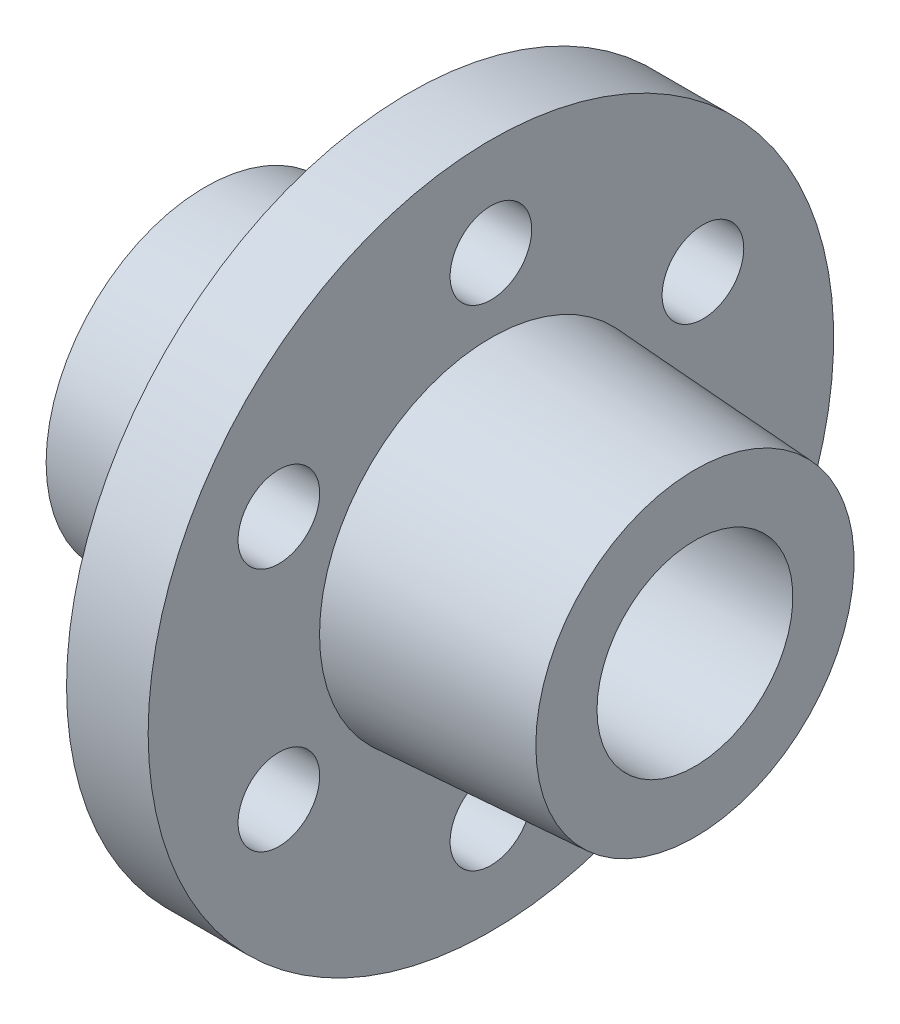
from build123d import *

# Parameters (mm, degrees)
SKETCH2_R          = 5
CUT_EXTRUDE1_DEPTH = 69.942004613


with BuildPart() as part:
    # Sketch1 → Revolve1 (revolve)
    with BuildSketch(Plane.XY, mode=Mode.PRIVATE) as revolve1_sk:
        Polygon((30, 12), (-30, 12), (-30, 19.5), (-5, 21), (-5, 42), (5, 42), (5, 21), (30, 19.5), align=None)
    revolve(revolve1_sk.sketch.rotate(Axis((-30, 0, 0), (1, 0, 0)), 90), axis=Axis((-30, 0, 0), (1, 0, 0)))

    # Sketch2 → Cut-Extrude1 (cut, through all)
    with BuildSketch(Plane(origin=(5, 0, 0), x_dir=(0, 0, -1), z_dir=(1, 0, 0))):
        with Locations((0, 30)):
            Circle(SKETCH2_R)
        with Locations((25.980762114, 15)):
            Circle(SKETCH2_R)
        with Locations((25.980762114, -15)):
            Circle(SKETCH2_R)
        with Locations((0, -30)):
            Circle(SKETCH2_R)
        with Locations((-25.980762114, -15)):
            Circle(SKETCH2_R)
        with Locations((-25.980762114, 15)):
            Circle(SKETCH2_R)
    extrude(amount=-CUT_EXTRUDE1_DEPTH, mode=Mode.SUBTRACT)


solid = part.part
